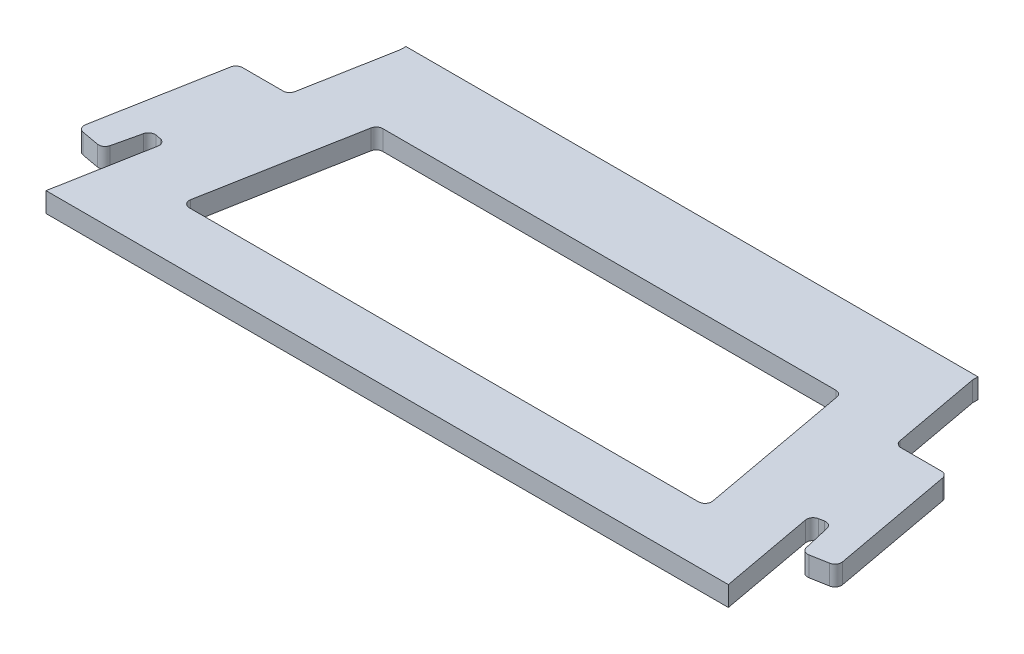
ISO-10303-21;
HEADER;
FILE_DESCRIPTION(('STEP AP214'),'2;1');
FILE_NAME('part.step','',(''),(''),'','','');
FILE_SCHEMA(('AUTOMOTIVE_DESIGN { 1 0 10303 214 1 1 1 1 }'));
ENDSEC;
DATA;
#1=APPLICATION_CONTEXT('core data for automotive mechanical design processes');
#2=APPLICATION_PROTOCOL_DEFINITION('international standard','automotive_design',2000,#1);
#3=PRODUCT_CONTEXT('',#1,'mechanical');
#4=PRODUCT('Part','Part','',(#3));
#5=PRODUCT_RELATED_PRODUCT_CATEGORY('part','',(#4));
#6=PRODUCT_DEFINITION_FORMATION('','',#4);
#7=PRODUCT_DEFINITION_CONTEXT('part definition',#1,'design');
#8=PRODUCT_DEFINITION('design','',#6,#7);
#9=PRODUCT_DEFINITION_SHAPE('','',#8);
#10=(LENGTH_UNIT() NAMED_UNIT(*) SI_UNIT(.MILLI.,.METRE.));
#11=(NAMED_UNIT(*) PLANE_ANGLE_UNIT() SI_UNIT($,.RADIAN.));
#12=(NAMED_UNIT(*) SI_UNIT($,.STERADIAN.) SOLID_ANGLE_UNIT());
#13=UNCERTAINTY_MEASURE_WITH_UNIT(LENGTH_MEASURE(1.E-05),#10,'distance_accuracy_value','');
#14=(GEOMETRIC_REPRESENTATION_CONTEXT(3) GLOBAL_UNCERTAINTY_ASSIGNED_CONTEXT((#13)) GLOBAL_UNIT_ASSIGNED_CONTEXT((#10,
#11,#12)) REPRESENTATION_CONTEXT('',''));
#15=CARTESIAN_POINT('',(0.,0.,0.));
#16=DIRECTION('',(0.,0.,1.));
#17=DIRECTION('',(1.,0.,0.));
#18=AXIS2_PLACEMENT_3D('',#15,#16,#17);
#19=CARTESIAN_POINT('',(6.58991666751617,12.,-57.8494094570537));
#20=DIRECTION('',(0.,-1.,0.));
#21=DIRECTION('',(0.,0.,-1.));
#22=AXIS2_PLACEMENT_3D('',#19,#20,#21);
#23=PLANE('',#22);
#24=DIRECTION('',(1.,0.,0.));
#25=VECTOR('',#24,1.);
#26=CARTESIAN_POINT('',(412.7,12.,0.));
#27=LINE('',#26,#25);
#28=CARTESIAN_POINT('',(0.,12.,0.));
#29=VERTEX_POINT('',#28);
#30=CARTESIAN_POINT('',(412.7,12.,0.));
#31=VERTEX_POINT('',#30);
#32=EDGE_CURVE('E343',#29,#31,#27,.T.);
#33=ORIENTED_EDGE('',*,*,#32,.T.);
#34=DIRECTION('',(-0.181174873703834,0.,-0.983450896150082));
#35=VECTOR('',#34,1.);
#36=CARTESIAN_POINT('',(402.176279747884,12.,-57.1247099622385));
#37=LINE('',#36,#35);
#38=CARTESIAN_POINT('',(402.176279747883,12.,-57.1247099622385));
#39=VERTEX_POINT('',#38);
#40=EDGE_CURVE('E346',#31,#39,#37,.T.);
#41=ORIENTED_EDGE('',*,*,#40,.T.);
#42=CARTESIAN_POINT('',(406.110083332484,12.,-57.8494094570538));
#43=DIRECTION('',(0.,-1.,0.));
#44=DIRECTION('',(0.,0.,1.));
#45=AXIS2_PLACEMENT_3D('',#42,#43,#44);
#46=CIRCLE('',#45,4.00000000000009);
#47=CARTESIAN_POINT('',(405.369598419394,12.,-61.7802722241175));
#48=VERTEX_POINT('',#47);
#49=EDGE_CURVE('E349',#39,#48,#46,.T.);
#50=ORIENTED_EDGE('',*,*,#49,.T.);
#51=DIRECTION('',(0.982715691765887,0.,-0.185121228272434));
#52=VECTOR('',#51,1.);
#53=CARTESIAN_POINT('',(408.44790778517,12.,-62.3601555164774));
#54=LINE('',#53,#52);
#55=CARTESIAN_POINT('',(408.44790778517,12.,-62.3601555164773));
#56=VERTEX_POINT('',#55);
#57=EDGE_CURVE('E351',#48,#56,#54,.T.);
#58=ORIENTED_EDGE('',*,*,#57,.T.);
#59=CARTESIAN_POINT('',(409.18839269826,12.,-58.4292927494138));
#60=DIRECTION('',(0.,-1.,0.));
#61=DIRECTION('',(0.,0.,1.));
#62=AXIS2_PLACEMENT_3D('',#59,#60,#61);
#63=CIRCLE('',#62,4.00000000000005);
#64=CARTESIAN_POINT('',(413.085272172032,12.,-59.3316953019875));
#65=VERTEX_POINT('',#64);
#66=EDGE_CURVE('E353',#56,#65,#63,.T.);
#67=ORIENTED_EDGE('',*,*,#66,.T.);
#68=DIRECTION('',(0.225600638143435,0.,0.974219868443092));
#69=VECTOR('',#68,1.);
#70=CARTESIAN_POINT('',(416.877618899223,12.,-42.9550593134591));
#71=LINE('',#70,#69);
#72=CARTESIAN_POINT('',(416.877618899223,12.,-42.9550593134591));
#73=VERTEX_POINT('',#72);
#74=EDGE_CURVE('E355',#65,#73,#71,.T.);
#75=ORIENTED_EDGE('',*,*,#74,.T.);
#76=CARTESIAN_POINT('',(420.774498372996,12.,-43.8574618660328));
#77=DIRECTION('',(0.,1.,0.));
#78=DIRECTION('',(0.,0.,-1.));
#79=AXIS2_PLACEMENT_3D('',#76,#77,#78);
#80=CIRCLE('',#79,3.99999999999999);
#81=CARTESIAN_POINT('',(421.487522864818,12.,-39.9215253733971));
#82=VERTEX_POINT('',#81);
#83=EDGE_CURVE('E357',#73,#82,#80,.T.);
#84=ORIENTED_EDGE('',*,*,#83,.T.);
#85=DIRECTION('',(0.983984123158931,0.,-0.178256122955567));
#86=VECTOR('',#85,1.);
#87=CARTESIAN_POINT('',(432.083346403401,12.,-41.8410384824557));
#88=LINE('',#87,#86);
#89=CARTESIAN_POINT('',(432.083346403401,12.,-41.8410384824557));
#90=VERTEX_POINT('',#89);
#91=EDGE_CURVE('E359',#82,#90,#88,.T.);
#92=ORIENTED_EDGE('',*,*,#91,.T.);
#93=CARTESIAN_POINT('',(431.370321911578,12.,-45.7769749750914));
#94=DIRECTION('',(0.,1.,0.));
#95=DIRECTION('',(0.,0.,-1.));
#96=AXIS2_PLACEMENT_3D('',#93,#94,#95);
#97=CIRCLE('',#96,4.);
#98=CARTESIAN_POINT('',(435.304125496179,12.,-46.5016744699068));
#99=VERTEX_POINT('',#98);
#100=EDGE_CURVE('E361',#90,#99,#97,.T.);
#101=ORIENTED_EDGE('',*,*,#100,.T.);
#102=DIRECTION('',(-0.181174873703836,0.,-0.983450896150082));
#103=VECTOR('',#102,1.);
#104=CARTESIAN_POINT('',(421.652598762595,12.,-120.604699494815));
#105=LINE('',#104,#103);
#106=CARTESIAN_POINT('',(421.652598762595,12.,-120.604699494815));
#107=VERTEX_POINT('',#106);
#108=EDGE_CURVE('E363',#99,#107,#105,.T.);
#109=ORIENTED_EDGE('',*,*,#108,.T.);
#110=CARTESIAN_POINT('',(417.718795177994,12.,-119.88));
#111=DIRECTION('',(0.,1.,0.));
#112=DIRECTION('',(0.,0.,-1.));
#113=AXIS2_PLACEMENT_3D('',#110,#111,#112);
#114=CIRCLE('',#113,4.);
#115=CARTESIAN_POINT('',(417.718795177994,12.,-123.88));
#116=VERTEX_POINT('',#115);
#117=EDGE_CURVE('E365',#107,#116,#114,.T.);
#118=ORIENTED_EDGE('',*,*,#117,.T.);
#119=DIRECTION('',(-1.,0.,0.));
#120=VECTOR('',#119,1.);
#121=CARTESIAN_POINT('',(393.208795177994,12.,-123.88));
#122=LINE('',#121,#120);
#123=CARTESIAN_POINT('',(393.208795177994,12.,-123.88));
#124=VERTEX_POINT('',#123);
#125=EDGE_CURVE('E367',#116,#124,#122,.T.);
#126=ORIENTED_EDGE('',*,*,#125,.T.);
#127=CARTESIAN_POINT('',(393.208795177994,12.,-127.88));
#128=DIRECTION('',(0.,-1.,0.));
#129=DIRECTION('',(0.,0.,-1.));
#130=AXIS2_PLACEMENT_3D('',#127,#128,#129);
#131=CIRCLE('',#130,4.00000000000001);
#132=CARTESIAN_POINT('',(389.274991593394,12.,-127.155300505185));
#133=VERTEX_POINT('',#132);
#134=EDGE_CURVE('E369',#124,#133,#131,.T.);
#135=ORIENTED_EDGE('',*,*,#134,.T.);
#136=DIRECTION('',(-0.181174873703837,0.,-0.983450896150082));
#137=VECTOR('',#136,1.);
#138=CARTESIAN_POINT('',(379.35,12.,-181.03));
#139=LINE('',#138,#137);
#140=CARTESIAN_POINT('',(379.35,12.,-181.03));
#141=VERTEX_POINT('',#140);
#142=EDGE_CURVE('E371',#133,#141,#139,.T.);
#143=ORIENTED_EDGE('',*,*,#142,.T.);
#144=DIRECTION('',(0.,0.,-1.));
#145=VECTOR('',#144,1.);
#146=CARTESIAN_POINT('',(379.35,12.,-181.03));
#147=LINE('',#146,#145);
#148=CARTESIAN_POINT('',(379.35,12.,-184.33));
#149=VERTEX_POINT('',#148);
#150=EDGE_CURVE('E373',#141,#149,#147,.T.);
#151=ORIENTED_EDGE('',*,*,#150,.T.);
#152=DIRECTION('',(-1.,0.,0.));
#153=VECTOR('',#152,1.);
#154=CARTESIAN_POINT('',(379.35,12.,-184.33));
#155=LINE('',#154,#153);
#156=CARTESIAN_POINT('',(33.35,12.,-184.33));
#157=VERTEX_POINT('',#156);
#158=EDGE_CURVE('E375',#149,#157,#155,.T.);
#159=ORIENTED_EDGE('',*,*,#158,.T.);
#160=DIRECTION('',(0.,0.,1.));
#161=VECTOR('',#160,1.);
#162=CARTESIAN_POINT('',(33.35,12.,-184.33));
#163=LINE('',#162,#161);
#164=CARTESIAN_POINT('',(33.35,12.,-181.03));
#165=VERTEX_POINT('',#164);
#166=EDGE_CURVE('E377',#157,#165,#163,.T.);
#167=ORIENTED_EDGE('',*,*,#166,.T.);
#168=DIRECTION('',(-0.181174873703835,0.,0.983450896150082));
#169=VECTOR('',#168,1.);
#170=CARTESIAN_POINT('',(23.4250084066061,12.,-127.155300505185));
#171=LINE('',#170,#169);
#172=CARTESIAN_POINT('',(23.4250084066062,12.,-127.155300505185));
#173=VERTEX_POINT('',#172);
#174=EDGE_CURVE('E379',#165,#173,#171,.T.);
#175=ORIENTED_EDGE('',*,*,#174,.T.);
#176=CARTESIAN_POINT('',(19.4912048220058,12.,-127.88));
#177=DIRECTION('',(0.,-1.,0.));
#178=DIRECTION('',(0.,0.,1.));
#179=AXIS2_PLACEMENT_3D('',#176,#177,#178);
#180=CIRCLE('',#179,4.00000000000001);
#181=CARTESIAN_POINT('',(19.4912048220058,12.,-123.88));
#182=VERTEX_POINT('',#181);
#183=EDGE_CURVE('E381',#173,#182,#180,.T.);
#184=ORIENTED_EDGE('',*,*,#183,.T.);
#185=DIRECTION('',(-1.,0.,0.));
#186=VECTOR('',#185,1.);
#187=CARTESIAN_POINT('',(19.4912048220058,12.,-123.88));
#188=LINE('',#187,#186);
#189=CARTESIAN_POINT('',(-5.01879517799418,12.,-123.88));
#190=VERTEX_POINT('',#189);
#191=EDGE_CURVE('E383',#182,#190,#188,.T.);
#192=ORIENTED_EDGE('',*,*,#191,.T.);
#193=CARTESIAN_POINT('',(-5.01879517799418,12.,-119.88));
#194=DIRECTION('',(0.,1.,0.));
#195=DIRECTION('',(0.,0.,1.));
#196=AXIS2_PLACEMENT_3D('',#193,#194,#195);
#197=CIRCLE('',#196,4.);
#198=CARTESIAN_POINT('',(-8.9525987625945,12.,-120.604699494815));
#199=VERTEX_POINT('',#198);
#200=EDGE_CURVE('E385',#190,#199,#197,.T.);
#201=ORIENTED_EDGE('',*,*,#200,.T.);
#202=DIRECTION('',(-0.181174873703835,0.,0.983450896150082));
#203=VECTOR('',#202,1.);
#204=CARTESIAN_POINT('',(-8.9525987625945,12.,-120.604699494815));
#205=LINE('',#204,#203);
#206=CARTESIAN_POINT('',(-22.6041254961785,12.,-46.5016744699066));
#207=VERTEX_POINT('',#206);
#208=EDGE_CURVE('E387',#199,#207,#205,.T.);
#209=ORIENTED_EDGE('',*,*,#208,.T.);
#210=CARTESIAN_POINT('',(-18.6703219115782,12.,-45.7769749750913));
#211=DIRECTION('',(0.,1.,0.));
#212=DIRECTION('',(0.,0.,1.));
#213=AXIS2_PLACEMENT_3D('',#210,#211,#212);
#214=CIRCLE('',#213,4.);
#215=CARTESIAN_POINT('',(-19.3833464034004,12.,-41.8410384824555));
#216=VERTEX_POINT('',#215);
#217=EDGE_CURVE('E389',#207,#216,#214,.T.);
#218=ORIENTED_EDGE('',*,*,#217,.T.);
#219=DIRECTION('',(0.983984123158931,0.,0.178256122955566));
#220=VECTOR('',#219,1.);
#221=CARTESIAN_POINT('',(-19.3833464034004,12.,-41.8410384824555));
#222=LINE('',#221,#220);
#223=CARTESIAN_POINT('',(-8.78752286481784,12.,-39.921525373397));
#224=VERTEX_POINT('',#223);
#225=EDGE_CURVE('E391',#216,#224,#222,.T.);
#226=ORIENTED_EDGE('',*,*,#225,.T.);
#227=CARTESIAN_POINT('',(-8.07449837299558,12.,-43.8574618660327));
#228=DIRECTION('',(0.,1.,0.));
#229=DIRECTION('',(0.,0.,1.));
#230=AXIS2_PLACEMENT_3D('',#227,#228,#229);
#231=CIRCLE('',#230,4.);
#232=CARTESIAN_POINT('',(-4.17761889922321,12.,-42.955059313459));
#233=VERTEX_POINT('',#232);
#234=EDGE_CURVE('E393',#224,#233,#231,.T.);
#235=ORIENTED_EDGE('',*,*,#234,.T.);
#236=DIRECTION('',(0.225600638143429,0.,-0.974219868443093));
#237=VECTOR('',#236,1.);
#238=CARTESIAN_POINT('',(-4.17761889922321,12.,-42.955059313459));
#239=LINE('',#238,#237);
#240=CARTESIAN_POINT('',(-0.385272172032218,12.,-59.3316953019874));
#241=VERTEX_POINT('',#240);
#242=EDGE_CURVE('E395',#233,#241,#239,.T.);
#243=ORIENTED_EDGE('',*,*,#242,.T.);
#244=CARTESIAN_POINT('',(3.51160730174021,12.,-58.4292927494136));
#245=DIRECTION('',(0.,-1.,0.));
#246=DIRECTION('',(0.,0.,-1.));
#247=AXIS2_PLACEMENT_3D('',#244,#245,#246);
#248=CIRCLE('',#247,4.00000000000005);
#249=CARTESIAN_POINT('',(4.25209221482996,12.,-62.3601555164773));
#250=VERTEX_POINT('',#249);
#251=EDGE_CURVE('E397',#241,#250,#248,.T.);
#252=ORIENTED_EDGE('',*,*,#251,.T.);
#253=DIRECTION('',(0.982715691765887,0.,0.185121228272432));
#254=VECTOR('',#253,1.);
#255=CARTESIAN_POINT('',(4.25209221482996,12.,-62.3601555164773));
#256=LINE('',#255,#254);
#257=CARTESIAN_POINT('',(7.33040158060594,12.,-61.7802722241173));
#258=VERTEX_POINT('',#257);
#259=EDGE_CURVE('E399',#250,#258,#256,.T.);
#260=ORIENTED_EDGE('',*,*,#259,.T.);
#261=CARTESIAN_POINT('',(6.58991666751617,12.,-57.8494094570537));
#262=DIRECTION('',(0.,-1.,0.));
#263=DIRECTION('',(0.,0.,-1.));
#264=AXIS2_PLACEMENT_3D('',#261,#262,#263);
#265=CIRCLE('',#264,4.00000000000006);
#266=CARTESIAN_POINT('',(10.5237202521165,12.,-57.1247099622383));
#267=VERTEX_POINT('',#266);
#268=EDGE_CURVE('E401',#258,#267,#265,.T.);
#269=ORIENTED_EDGE('',*,*,#268,.T.);
#270=DIRECTION('',(-0.181174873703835,0.,0.983450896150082));
#271=VECTOR('',#270,1.);
#272=CARTESIAN_POINT('',(0.,12.,0.));
#273=LINE('',#272,#271);
#274=EDGE_CURVE('E403',#267,#29,#273,.T.);
#275=ORIENTED_EDGE('',*,*,#274,.T.);
#276=EDGE_LOOP('',(#33,#41,#50,#58,#67,#75,#84,#92,#101,#109,#118,#126,#135,#143,#151,#159,#167,
#175,#184,#192,#201,#209,#218,#226,#235,#243,#252,#260,#269,#275));
#277=FACE_BOUND('',#276,.T.);
#278=CARTESIAN_POINT('',(52.4118012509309,12.,-38.33));
#279=DIRECTION('',(0.,1.,0.));
#280=DIRECTION('',(0.,0.,1.));
#281=AXIS2_PLACEMENT_3D('',#278,#279,#280);
#282=CIRCLE('',#281,4.);
#283=CARTESIAN_POINT('',(48.4779976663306,12.,-39.0546994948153));
#284=VERTEX_POINT('',#283);
#285=CARTESIAN_POINT('',(52.4118012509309,12.,-34.33));
#286=VERTEX_POINT('',#285);
#287=EDGE_CURVE('E278',#284,#286,#282,.T.);
#288=ORIENTED_EDGE('',*,*,#287,.F.);
#289=DIRECTION('',(-0.181174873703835,0.,0.983450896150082));
#290=VECTOR('',#289,1.);
#291=CARTESIAN_POINT('',(65.4265697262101,12.,-131.054699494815));
#292=LINE('',#291,#290);
#293=CARTESIAN_POINT('',(65.4265697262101,12.,-131.054699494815));
#294=VERTEX_POINT('',#293);
#295=EDGE_CURVE('E311',#294,#284,#292,.T.);
#296=ORIENTED_EDGE('',*,*,#295,.F.);
#297=CARTESIAN_POINT('',(69.3603733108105,12.,-130.33));
#298=DIRECTION('',(0.,1.,0.));
#299=DIRECTION('',(0.,0.,1.));
#300=AXIS2_PLACEMENT_3D('',#297,#298,#299);
#301=CIRCLE('',#300,4.00000000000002);
#302=CARTESIAN_POINT('',(69.3603733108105,12.,-134.33));
#303=VERTEX_POINT('',#302);
#304=EDGE_CURVE('E309',#303,#294,#301,.T.);
#305=ORIENTED_EDGE('',*,*,#304,.F.);
#306=DIRECTION('',(-1.,0.,0.));
#307=VECTOR('',#306,1.);
#308=CARTESIAN_POINT('',(343.33962668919,12.,-134.33));
#309=LINE('',#308,#307);
#310=CARTESIAN_POINT('',(343.33962668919,12.,-134.33));
#311=VERTEX_POINT('',#310);
#312=EDGE_CURVE('E307',#311,#303,#309,.T.);
#313=ORIENTED_EDGE('',*,*,#312,.F.);
#314=CARTESIAN_POINT('',(343.33962668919,12.,-130.33));
#315=DIRECTION('',(0.,1.,0.));
#316=DIRECTION('',(0.,0.,-1.));
#317=AXIS2_PLACEMENT_3D('',#314,#315,#316);
#318=CIRCLE('',#317,4.00000000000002);
#319=CARTESIAN_POINT('',(347.27343027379,12.,-131.054699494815));
#320=VERTEX_POINT('',#319);
#321=EDGE_CURVE('E305',#320,#311,#318,.T.);
#322=ORIENTED_EDGE('',*,*,#321,.F.);
#323=DIRECTION('',(-0.181174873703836,0.,-0.983450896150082));
#324=VECTOR('',#323,1.);
#325=CARTESIAN_POINT('',(347.27343027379,12.,-131.054699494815));
#326=LINE('',#325,#324);
#327=CARTESIAN_POINT('',(364.222002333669,12.,-39.0546994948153));
#328=VERTEX_POINT('',#327);
#329=EDGE_CURVE('E301',#328,#320,#326,.T.);
#330=ORIENTED_EDGE('',*,*,#329,.F.);
#331=CARTESIAN_POINT('',(360.288198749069,12.,-38.33));
#332=DIRECTION('',(0.,1.,0.));
#333=DIRECTION('',(0.,0.,-1.));
#334=AXIS2_PLACEMENT_3D('',#331,#332,#333);
#335=CIRCLE('',#334,4.00000000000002);
#336=CARTESIAN_POINT('',(360.288198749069,12.,-34.3299999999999));
#337=VERTEX_POINT('',#336);
#338=EDGE_CURVE('E299',#337,#328,#335,.T.);
#339=ORIENTED_EDGE('',*,*,#338,.F.);
#340=DIRECTION('',(1.,0.,0.));
#341=VECTOR('',#340,1.);
#342=CARTESIAN_POINT('',(52.4118012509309,12.,-34.33));
#343=LINE('',#342,#341);
#344=EDGE_CURVE('E286',#286,#337,#343,.T.);
#345=ORIENTED_EDGE('',*,*,#344,.F.);
#346=EDGE_LOOP('',(#288,#296,#305,#313,#322,#330,#339,#345));
#347=FACE_BOUND('',#346,.T.);
#348=ADVANCED_FACE('F33',(#277,#347),#23,.F.);
#349=CARTESIAN_POINT('',(6.58991666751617,0.,-57.8494094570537));
#350=DIRECTION('',(0.,-1.,0.));
#351=DIRECTION('',(0.,0.,-1.));
#352=AXIS2_PLACEMENT_3D('',#349,#350,#351);
#353=PLANE('',#352);
#354=DIRECTION('',(1.,0.,0.));
#355=VECTOR('',#354,1.);
#356=CARTESIAN_POINT('',(412.7,0.,0.));
#357=LINE('',#356,#355);
#358=CARTESIAN_POINT('',(0.,0.,0.));
#359=VERTEX_POINT('',#358);
#360=CARTESIAN_POINT('',(412.7,0.,0.));
#361=VERTEX_POINT('',#360);
#362=EDGE_CURVE('E294',#359,#361,#357,.T.);
#363=ORIENTED_EDGE('',*,*,#362,.F.);
#364=DIRECTION('',(-0.181174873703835,0.,0.983450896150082));
#365=VECTOR('',#364,1.);
#366=CARTESIAN_POINT('',(0.,0.,0.));
#367=LINE('',#366,#365);
#368=CARTESIAN_POINT('',(10.5237202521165,0.,-57.1247099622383));
#369=VERTEX_POINT('',#368);
#370=EDGE_CURVE('E347',#369,#359,#367,.T.);
#371=ORIENTED_EDGE('',*,*,#370,.F.);
#372=CARTESIAN_POINT('',(6.58991666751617,0.,-57.8494094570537));
#373=DIRECTION('',(0.,-1.,0.));
#374=DIRECTION('',(0.,0.,-1.));
#375=AXIS2_PLACEMENT_3D('',#372,#373,#374);
#376=CIRCLE('',#375,4.00000000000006);
#377=CARTESIAN_POINT('',(7.33040158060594,0.,-61.7802722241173));
#378=VERTEX_POINT('',#377);
#379=EDGE_CURVE('E462',#378,#369,#376,.T.);
#380=ORIENTED_EDGE('',*,*,#379,.F.);
#381=DIRECTION('',(0.982715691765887,0.,0.185121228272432));
#382=VECTOR('',#381,1.);
#383=CARTESIAN_POINT('',(4.25209221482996,0.,-62.3601555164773));
#384=LINE('',#383,#382);
#385=CARTESIAN_POINT('',(4.25209221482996,0.,-62.3601555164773));
#386=VERTEX_POINT('',#385);
#387=EDGE_CURVE('E460',#386,#378,#384,.T.);
#388=ORIENTED_EDGE('',*,*,#387,.F.);
#389=CARTESIAN_POINT('',(3.51160730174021,0.,-58.4292927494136));
#390=DIRECTION('',(0.,-1.,0.));
#391=DIRECTION('',(0.,0.,-1.));
#392=AXIS2_PLACEMENT_3D('',#389,#390,#391);
#393=CIRCLE('',#392,4.00000000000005);
#394=CARTESIAN_POINT('',(-0.385272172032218,0.,-59.3316953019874));
#395=VERTEX_POINT('',#394);
#396=EDGE_CURVE('E458',#395,#386,#393,.T.);
#397=ORIENTED_EDGE('',*,*,#396,.F.);
#398=DIRECTION('',(0.225600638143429,0.,-0.974219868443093));
#399=VECTOR('',#398,1.);
#400=CARTESIAN_POINT('',(-4.17761889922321,0.,-42.955059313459));
#401=LINE('',#400,#399);
#402=CARTESIAN_POINT('',(-4.17761889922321,0.,-42.955059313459));
#403=VERTEX_POINT('',#402);
#404=EDGE_CURVE('E456',#403,#395,#401,.T.);
#405=ORIENTED_EDGE('',*,*,#404,.F.);
#406=CARTESIAN_POINT('',(-8.07449837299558,0.,-43.8574618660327));
#407=DIRECTION('',(0.,1.,0.));
#408=DIRECTION('',(0.,0.,1.));
#409=AXIS2_PLACEMENT_3D('',#406,#407,#408);
#410=CIRCLE('',#409,4.);
#411=CARTESIAN_POINT('',(-8.78752286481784,0.,-39.921525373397));
#412=VERTEX_POINT('',#411);
#413=EDGE_CURVE('E454',#412,#403,#410,.T.);
#414=ORIENTED_EDGE('',*,*,#413,.F.);
#415=DIRECTION('',(0.983984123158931,0.,0.178256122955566));
#416=VECTOR('',#415,1.);
#417=CARTESIAN_POINT('',(-19.3833464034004,0.,-41.8410384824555));
#418=LINE('',#417,#416);
#419=CARTESIAN_POINT('',(-19.3833464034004,0.,-41.8410384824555));
#420=VERTEX_POINT('',#419);
#421=EDGE_CURVE('E452',#420,#412,#418,.T.);
#422=ORIENTED_EDGE('',*,*,#421,.F.);
#423=CARTESIAN_POINT('',(-18.6703219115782,0.,-45.7769749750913));
#424=DIRECTION('',(0.,1.,0.));
#425=DIRECTION('',(0.,0.,1.));
#426=AXIS2_PLACEMENT_3D('',#423,#424,#425);
#427=CIRCLE('',#426,4.);
#428=CARTESIAN_POINT('',(-22.6041254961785,0.,-46.5016744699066));
#429=VERTEX_POINT('',#428);
#430=EDGE_CURVE('E450',#429,#420,#427,.T.);
#431=ORIENTED_EDGE('',*,*,#430,.F.);
#432=DIRECTION('',(-0.181174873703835,0.,0.983450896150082));
#433=VECTOR('',#432,1.);
#434=CARTESIAN_POINT('',(-8.9525987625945,0.,-120.604699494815));
#435=LINE('',#434,#433);
#436=CARTESIAN_POINT('',(-8.9525987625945,0.,-120.604699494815));
#437=VERTEX_POINT('',#436);
#438=EDGE_CURVE('E448',#437,#429,#435,.T.);
#439=ORIENTED_EDGE('',*,*,#438,.F.);
#440=CARTESIAN_POINT('',(-5.01879517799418,0.,-119.88));
#441=DIRECTION('',(0.,1.,0.));
#442=DIRECTION('',(0.,0.,1.));
#443=AXIS2_PLACEMENT_3D('',#440,#441,#442);
#444=CIRCLE('',#443,4.);
#445=CARTESIAN_POINT('',(-5.01879517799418,0.,-123.88));
#446=VERTEX_POINT('',#445);
#447=EDGE_CURVE('E446',#446,#437,#444,.T.);
#448=ORIENTED_EDGE('',*,*,#447,.F.);
#449=DIRECTION('',(-1.,0.,0.));
#450=VECTOR('',#449,1.);
#451=CARTESIAN_POINT('',(19.4912048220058,0.,-123.88));
#452=LINE('',#451,#450);
#453=CARTESIAN_POINT('',(19.4912048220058,0.,-123.88));
#454=VERTEX_POINT('',#453);
#455=EDGE_CURVE('E444',#454,#446,#452,.T.);
#456=ORIENTED_EDGE('',*,*,#455,.F.);
#457=CARTESIAN_POINT('',(19.4912048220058,0.,-127.88));
#458=DIRECTION('',(0.,-1.,0.));
#459=DIRECTION('',(0.,0.,1.));
#460=AXIS2_PLACEMENT_3D('',#457,#458,#459);
#461=CIRCLE('',#460,4.00000000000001);
#462=CARTESIAN_POINT('',(23.4250084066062,0.,-127.155300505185));
#463=VERTEX_POINT('',#462);
#464=EDGE_CURVE('E442',#463,#454,#461,.T.);
#465=ORIENTED_EDGE('',*,*,#464,.F.);
#466=DIRECTION('',(-0.181174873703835,0.,0.983450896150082));
#467=VECTOR('',#466,1.);
#468=CARTESIAN_POINT('',(23.4250084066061,0.,-127.155300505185));
#469=LINE('',#468,#467);
#470=CARTESIAN_POINT('',(33.35,0.,-181.03));
#471=VERTEX_POINT('',#470);
#472=EDGE_CURVE('E440',#471,#463,#469,.T.);
#473=ORIENTED_EDGE('',*,*,#472,.F.);
#474=DIRECTION('',(0.,0.,1.));
#475=VECTOR('',#474,1.);
#476=CARTESIAN_POINT('',(33.35,0.,-184.33));
#477=LINE('',#476,#475);
#478=CARTESIAN_POINT('',(33.35,0.,-184.33));
#479=VERTEX_POINT('',#478);
#480=EDGE_CURVE('E438',#479,#471,#477,.T.);
#481=ORIENTED_EDGE('',*,*,#480,.F.);
#482=DIRECTION('',(-1.,0.,0.));
#483=VECTOR('',#482,1.);
#484=CARTESIAN_POINT('',(379.35,0.,-184.33));
#485=LINE('',#484,#483);
#486=CARTESIAN_POINT('',(379.35,0.,-184.33));
#487=VERTEX_POINT('',#486);
#488=EDGE_CURVE('E436',#487,#479,#485,.T.);
#489=ORIENTED_EDGE('',*,*,#488,.F.);
#490=DIRECTION('',(0.,0.,-1.));
#491=VECTOR('',#490,1.);
#492=CARTESIAN_POINT('',(379.35,0.,-181.03));
#493=LINE('',#492,#491);
#494=CARTESIAN_POINT('',(379.35,0.,-181.03));
#495=VERTEX_POINT('',#494);
#496=EDGE_CURVE('E434',#495,#487,#493,.T.);
#497=ORIENTED_EDGE('',*,*,#496,.F.);
#498=DIRECTION('',(-0.181174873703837,0.,-0.983450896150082));
#499=VECTOR('',#498,1.);
#500=CARTESIAN_POINT('',(379.35,0.,-181.03));
#501=LINE('',#500,#499);
#502=CARTESIAN_POINT('',(389.274991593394,0.,-127.155300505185));
#503=VERTEX_POINT('',#502);
#504=EDGE_CURVE('E432',#503,#495,#501,.T.);
#505=ORIENTED_EDGE('',*,*,#504,.F.);
#506=CARTESIAN_POINT('',(393.208795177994,0.,-127.88));
#507=DIRECTION('',(0.,-1.,0.));
#508=DIRECTION('',(0.,0.,-1.));
#509=AXIS2_PLACEMENT_3D('',#506,#507,#508);
#510=CIRCLE('',#509,4.00000000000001);
#511=CARTESIAN_POINT('',(393.208795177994,0.,-123.88));
#512=VERTEX_POINT('',#511);
#513=EDGE_CURVE('E430',#512,#503,#510,.T.);
#514=ORIENTED_EDGE('',*,*,#513,.F.);
#515=DIRECTION('',(-1.,0.,0.));
#516=VECTOR('',#515,1.);
#517=CARTESIAN_POINT('',(393.208795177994,0.,-123.88));
#518=LINE('',#517,#516);
#519=CARTESIAN_POINT('',(417.718795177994,0.,-123.88));
#520=VERTEX_POINT('',#519);
#521=EDGE_CURVE('E428',#520,#512,#518,.T.);
#522=ORIENTED_EDGE('',*,*,#521,.F.);
#523=CARTESIAN_POINT('',(417.718795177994,0.,-119.88));
#524=DIRECTION('',(0.,1.,0.));
#525=DIRECTION('',(0.,0.,-1.));
#526=AXIS2_PLACEMENT_3D('',#523,#524,#525);
#527=CIRCLE('',#526,4.);
#528=CARTESIAN_POINT('',(421.652598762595,0.,-120.604699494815));
#529=VERTEX_POINT('',#528);
#530=EDGE_CURVE('E426',#529,#520,#527,.T.);
#531=ORIENTED_EDGE('',*,*,#530,.F.);
#532=DIRECTION('',(-0.181174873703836,0.,-0.983450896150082));
#533=VECTOR('',#532,1.);
#534=CARTESIAN_POINT('',(421.652598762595,0.,-120.604699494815));
#535=LINE('',#534,#533);
#536=CARTESIAN_POINT('',(435.304125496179,0.,-46.5016744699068));
#537=VERTEX_POINT('',#536);
#538=EDGE_CURVE('E424',#537,#529,#535,.T.);
#539=ORIENTED_EDGE('',*,*,#538,.F.);
#540=CARTESIAN_POINT('',(431.370321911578,0.,-45.7769749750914));
#541=DIRECTION('',(0.,1.,0.));
#542=DIRECTION('',(0.,0.,-1.));
#543=AXIS2_PLACEMENT_3D('',#540,#541,#542);
#544=CIRCLE('',#543,4.);
#545=CARTESIAN_POINT('',(432.083346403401,0.,-41.8410384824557));
#546=VERTEX_POINT('',#545);
#547=EDGE_CURVE('E422',#546,#537,#544,.T.);
#548=ORIENTED_EDGE('',*,*,#547,.F.);
#549=DIRECTION('',(0.983984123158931,0.,-0.178256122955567));
#550=VECTOR('',#549,1.);
#551=CARTESIAN_POINT('',(432.083346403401,0.,-41.8410384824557));
#552=LINE('',#551,#550);
#553=CARTESIAN_POINT('',(421.487522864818,0.,-39.9215253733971));
#554=VERTEX_POINT('',#553);
#555=EDGE_CURVE('E420',#554,#546,#552,.T.);
#556=ORIENTED_EDGE('',*,*,#555,.F.);
#557=CARTESIAN_POINT('',(420.774498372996,0.,-43.8574618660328));
#558=DIRECTION('',(0.,1.,0.));
#559=DIRECTION('',(0.,0.,-1.));
#560=AXIS2_PLACEMENT_3D('',#557,#558,#559);
#561=CIRCLE('',#560,3.99999999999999);
#562=CARTESIAN_POINT('',(416.877618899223,0.,-42.9550593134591));
#563=VERTEX_POINT('',#562);
#564=EDGE_CURVE('E418',#563,#554,#561,.T.);
#565=ORIENTED_EDGE('',*,*,#564,.F.);
#566=DIRECTION('',(0.225600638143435,0.,0.974219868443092));
#567=VECTOR('',#566,1.);
#568=CARTESIAN_POINT('',(416.877618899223,0.,-42.9550593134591));
#569=LINE('',#568,#567);
#570=CARTESIAN_POINT('',(413.085272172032,0.,-59.3316953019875));
#571=VERTEX_POINT('',#570);
#572=EDGE_CURVE('E416',#571,#563,#569,.T.);
#573=ORIENTED_EDGE('',*,*,#572,.F.);
#574=CARTESIAN_POINT('',(409.18839269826,0.,-58.4292927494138));
#575=DIRECTION('',(0.,-1.,0.));
#576=DIRECTION('',(0.,0.,1.));
#577=AXIS2_PLACEMENT_3D('',#574,#575,#576);
#578=CIRCLE('',#577,4.00000000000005);
#579=CARTESIAN_POINT('',(408.44790778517,0.,-62.3601555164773));
#580=VERTEX_POINT('',#579);
#581=EDGE_CURVE('E414',#580,#571,#578,.T.);
#582=ORIENTED_EDGE('',*,*,#581,.F.);
#583=DIRECTION('',(0.982715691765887,0.,-0.185121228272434));
#584=VECTOR('',#583,1.);
#585=CARTESIAN_POINT('',(408.44790778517,0.,-62.3601555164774));
#586=LINE('',#585,#584);
#587=CARTESIAN_POINT('',(405.369598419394,0.,-61.7802722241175));
#588=VERTEX_POINT('',#587);
#589=EDGE_CURVE('E412',#588,#580,#586,.T.);
#590=ORIENTED_EDGE('',*,*,#589,.F.);
#591=CARTESIAN_POINT('',(406.110083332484,0.,-57.8494094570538));
#592=DIRECTION('',(0.,-1.,0.));
#593=DIRECTION('',(0.,0.,1.));
#594=AXIS2_PLACEMENT_3D('',#591,#592,#593);
#595=CIRCLE('',#594,4.00000000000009);
#596=CARTESIAN_POINT('',(402.176279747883,0.,-57.1247099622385));
#597=VERTEX_POINT('',#596);
#598=EDGE_CURVE('E410',#597,#588,#595,.T.);
#599=ORIENTED_EDGE('',*,*,#598,.F.);
#600=DIRECTION('',(-0.181174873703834,0.,-0.983450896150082));
#601=VECTOR('',#600,1.);
#602=CARTESIAN_POINT('',(402.176279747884,0.,-57.1247099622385));
#603=LINE('',#602,#601);
#604=EDGE_CURVE('E408',#361,#597,#603,.T.);
#605=ORIENTED_EDGE('',*,*,#604,.F.);
#606=EDGE_LOOP('',(#363,#371,#380,#388,#397,#405,#414,#422,#431,#439,#448,#456,#465,#473,#481,
#489,#497,#505,#514,#522,#531,#539,#548,#556,#565,#573,#582,#590,#599,#605));
#607=FACE_BOUND('',#606,.T.);
#608=DIRECTION('',(-0.181174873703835,0.,0.983450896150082));
#609=VECTOR('',#608,1.);
#610=CARTESIAN_POINT('',(65.4265697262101,0.,-131.054699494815));
#611=LINE('',#610,#609);
#612=CARTESIAN_POINT('',(65.4265697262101,0.,-131.054699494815));
#613=VERTEX_POINT('',#612);
#614=CARTESIAN_POINT('',(48.4779976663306,0.,-39.0546994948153));
#615=VERTEX_POINT('',#614);
#616=EDGE_CURVE('E287',#613,#615,#611,.T.);
#617=ORIENTED_EDGE('',*,*,#616,.T.);
#618=CARTESIAN_POINT('',(52.4118012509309,0.,-38.33));
#619=DIRECTION('',(0.,1.,0.));
#620=DIRECTION('',(0.,0.,1.));
#621=AXIS2_PLACEMENT_3D('',#618,#619,#620);
#622=CIRCLE('',#621,4.);
#623=CARTESIAN_POINT('',(52.4118012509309,0.,-34.33));
#624=VERTEX_POINT('',#623);
#625=EDGE_CURVE('E56',#615,#624,#622,.T.);
#626=ORIENTED_EDGE('',*,*,#625,.T.);
#627=DIRECTION('',(1.,0.,0.));
#628=VECTOR('',#627,1.);
#629=CARTESIAN_POINT('',(52.4118012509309,0.,-34.33));
#630=LINE('',#629,#628);
#631=CARTESIAN_POINT('',(360.288198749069,0.,-34.3299999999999));
#632=VERTEX_POINT('',#631);
#633=EDGE_CURVE('E293',#624,#632,#630,.T.);
#634=ORIENTED_EDGE('',*,*,#633,.T.);
#635=CARTESIAN_POINT('',(360.288198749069,0.,-38.33));
#636=DIRECTION('',(0.,1.,0.));
#637=DIRECTION('',(0.,0.,-1.));
#638=AXIS2_PLACEMENT_3D('',#635,#636,#637);
#639=CIRCLE('',#638,4.00000000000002);
#640=CARTESIAN_POINT('',(364.222002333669,0.,-39.0546994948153));
#641=VERTEX_POINT('',#640);
#642=EDGE_CURVE('E315',#632,#641,#639,.T.);
#643=ORIENTED_EDGE('',*,*,#642,.T.);
#644=DIRECTION('',(-0.181174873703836,0.,-0.983450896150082));
#645=VECTOR('',#644,1.);
#646=CARTESIAN_POINT('',(347.27343027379,0.,-131.054699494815));
#647=LINE('',#646,#645);
#648=CARTESIAN_POINT('',(347.27343027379,0.,-131.054699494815));
#649=VERTEX_POINT('',#648);
#650=EDGE_CURVE('E318',#641,#649,#647,.T.);
#651=ORIENTED_EDGE('',*,*,#650,.T.);
#652=CARTESIAN_POINT('',(343.33962668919,0.,-130.33));
#653=DIRECTION('',(0.,1.,0.));
#654=DIRECTION('',(0.,0.,-1.));
#655=AXIS2_PLACEMENT_3D('',#652,#653,#654);
#656=CIRCLE('',#655,4.00000000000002);
#657=CARTESIAN_POINT('',(343.33962668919,0.,-134.33));
#658=VERTEX_POINT('',#657);
#659=EDGE_CURVE('E321',#649,#658,#656,.T.);
#660=ORIENTED_EDGE('',*,*,#659,.T.);
#661=DIRECTION('',(-1.,0.,0.));
#662=VECTOR('',#661,1.);
#663=CARTESIAN_POINT('',(343.33962668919,0.,-134.33));
#664=LINE('',#663,#662);
#665=CARTESIAN_POINT('',(69.3603733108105,0.,-134.33));
#666=VERTEX_POINT('',#665);
#667=EDGE_CURVE('E324',#658,#666,#664,.T.);
#668=ORIENTED_EDGE('',*,*,#667,.T.);
#669=CARTESIAN_POINT('',(69.3603733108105,0.,-130.33));
#670=DIRECTION('',(0.,1.,0.));
#671=DIRECTION('',(0.,0.,1.));
#672=AXIS2_PLACEMENT_3D('',#669,#670,#671);
#673=CIRCLE('',#672,4.00000000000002);
#674=EDGE_CURVE('E327',#666,#613,#673,.T.);
#675=ORIENTED_EDGE('',*,*,#674,.T.);
#676=EDGE_LOOP('',(#617,#626,#634,#643,#651,#660,#668,#675));
#677=FACE_BOUND('',#676,.T.);
#678=ADVANCED_FACE('F558',(#607,#677),#353,.T.);
#679=CARTESIAN_POINT('',(412.7,12.,0.));
#680=DIRECTION('',(0.,0.,-1.));
#681=DIRECTION('',(-1.,0.,0.));
#682=AXIS2_PLACEMENT_3D('',#679,#680,#681);
#683=PLANE('',#682);
#684=ORIENTED_EDGE('',*,*,#362,.T.);
#685=DIRECTION('',(0.,-1.,0.));
#686=VECTOR('',#685,1.);
#687=CARTESIAN_POINT('',(412.7,12.,0.));
#688=LINE('',#687,#686);
#689=EDGE_CURVE('E11',#31,#361,#688,.T.);
#690=ORIENTED_EDGE('',*,*,#689,.F.);
#691=ORIENTED_EDGE('',*,*,#32,.F.);
#692=DIRECTION('',(0.,-1.,0.));
#693=VECTOR('',#692,1.);
#694=CARTESIAN_POINT('',(0.,12.,0.));
#695=LINE('',#694,#693);
#696=EDGE_CURVE('E405',#29,#359,#695,.T.);
#697=ORIENTED_EDGE('',*,*,#696,.T.);
#698=EDGE_LOOP('',(#684,#690,#691,#697));
#699=FACE_BOUND('',#698,.T.);
#700=ADVANCED_FACE('F35',(#699),#683,.F.);
#701=CARTESIAN_POINT('',(402.176279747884,12.,-57.1247099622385));
#702=DIRECTION('',(-0.983450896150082,0.,0.181174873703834));
#703=DIRECTION('',(0.181174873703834,0.,0.983450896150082));
#704=AXIS2_PLACEMENT_3D('',#701,#702,#703);
#705=PLANE('',#704);
#706=ORIENTED_EDGE('',*,*,#604,.T.);
#707=DIRECTION('',(0.,-1.,0.));
#708=VECTOR('',#707,1.);
#709=CARTESIAN_POINT('',(402.176279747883,12.,-57.1247099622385));
#710=LINE('',#709,#708);
#711=EDGE_CURVE('E41',#39,#597,#710,.T.);
#712=ORIENTED_EDGE('',*,*,#711,.F.);
#713=ORIENTED_EDGE('',*,*,#40,.F.);
#714=ORIENTED_EDGE('',*,*,#689,.T.);
#715=EDGE_LOOP('',(#706,#712,#713,#714));
#716=FACE_BOUND('',#715,.T.);
#717=ADVANCED_FACE('F575',(#716),#705,.F.);
#718=CARTESIAN_POINT('',(406.110083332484,12.,-57.8494094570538));
#719=DIRECTION('',(0.,-1.,0.));
#720=DIRECTION('',(0.,0.,-1.));
#721=AXIS2_PLACEMENT_3D('',#718,#719,#720);
#722=CYLINDRICAL_SURFACE('',#721,4.00000000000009);
#723=ORIENTED_EDGE('',*,*,#598,.T.);
#724=DIRECTION('',(0.,-1.,0.));
#725=VECTOR('',#724,1.);
#726=CARTESIAN_POINT('',(405.369598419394,12.,-61.7802722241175));
#727=LINE('',#726,#725);
#728=EDGE_CURVE('E545',#48,#588,#727,.T.);
#729=ORIENTED_EDGE('',*,*,#728,.F.);
#730=ORIENTED_EDGE('',*,*,#49,.F.);
#731=ORIENTED_EDGE('',*,*,#711,.T.);
#732=EDGE_LOOP('',(#723,#729,#730,#731));
#733=FACE_BOUND('',#732,.T.);
#734=ADVANCED_FACE('F552',(#733),#722,.F.);
#735=CARTESIAN_POINT('',(408.44790778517,12.,-62.3601555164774));
#736=DIRECTION('',(-0.185121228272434,0.,-0.982715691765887));
#737=DIRECTION('',(-0.982715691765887,0.,0.185121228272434));
#738=AXIS2_PLACEMENT_3D('',#735,#736,#737);
#739=PLANE('',#738);
#740=ORIENTED_EDGE('',*,*,#589,.T.);
#741=DIRECTION('',(0.,-1.,0.));
#742=VECTOR('',#741,1.);
#743=CARTESIAN_POINT('',(408.44790778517,12.,-62.3601555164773));
#744=LINE('',#743,#742);
#745=EDGE_CURVE('E542',#56,#580,#744,.T.);
#746=ORIENTED_EDGE('',*,*,#745,.F.);
#747=ORIENTED_EDGE('',*,*,#57,.F.);
#748=ORIENTED_EDGE('',*,*,#728,.T.);
#749=EDGE_LOOP('',(#740,#746,#747,#748));
#750=FACE_BOUND('',#749,.T.);
#751=ADVANCED_FACE('F564',(#750),#739,.F.);
#752=CARTESIAN_POINT('',(409.18839269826,12.,-58.4292927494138));
#753=DIRECTION('',(0.,-1.,0.));
#754=DIRECTION('',(0.,0.,-1.));
#755=AXIS2_PLACEMENT_3D('',#752,#753,#754);
#756=CYLINDRICAL_SURFACE('',#755,4.00000000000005);
#757=ORIENTED_EDGE('',*,*,#581,.T.);
#758=DIRECTION('',(0.,-1.,0.));
#759=VECTOR('',#758,1.);
#760=CARTESIAN_POINT('',(413.085272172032,12.,-59.3316953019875));
#761=LINE('',#760,#759);
#762=EDGE_CURVE('E539',#65,#571,#761,.T.);
#763=ORIENTED_EDGE('',*,*,#762,.F.);
#764=ORIENTED_EDGE('',*,*,#66,.F.);
#765=ORIENTED_EDGE('',*,*,#745,.T.);
#766=EDGE_LOOP('',(#757,#763,#764,#765));
#767=FACE_BOUND('',#766,.T.);
#768=ADVANCED_FACE('F568',(#767),#756,.F.);
#769=CARTESIAN_POINT('',(416.877618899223,12.,-42.9550593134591));
#770=DIRECTION('',(0.974219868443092,0.,-0.225600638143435));
#771=DIRECTION('',(-0.225600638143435,0.,-0.974219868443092));
#772=AXIS2_PLACEMENT_3D('',#769,#770,#771);
#773=PLANE('',#772);
#774=ORIENTED_EDGE('',*,*,#572,.T.);
#775=DIRECTION('',(0.,-1.,0.));
#776=VECTOR('',#775,1.);
#777=CARTESIAN_POINT('',(416.877618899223,12.,-42.9550593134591));
#778=LINE('',#777,#776);
#779=EDGE_CURVE('E536',#73,#563,#778,.T.);
#780=ORIENTED_EDGE('',*,*,#779,.F.);
#781=ORIENTED_EDGE('',*,*,#74,.F.);
#782=ORIENTED_EDGE('',*,*,#762,.T.);
#783=EDGE_LOOP('',(#774,#780,#781,#782));
#784=FACE_BOUND('',#783,.T.);
#785=ADVANCED_FACE('F698',(#784),#773,.F.);
#786=CARTESIAN_POINT('',(420.774498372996,12.,-43.8574618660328));
#787=DIRECTION('',(0.,-1.,0.));
#788=DIRECTION('',(0.,0.,-1.));
#789=AXIS2_PLACEMENT_3D('',#786,#787,#788);
#790=CYLINDRICAL_SURFACE('',#789,3.99999999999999);
#791=ORIENTED_EDGE('',*,*,#564,.T.);
#792=DIRECTION('',(0.,-1.,0.));
#793=VECTOR('',#792,1.);
#794=CARTESIAN_POINT('',(421.487522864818,12.,-39.9215253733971));
#795=LINE('',#794,#793);
#796=EDGE_CURVE('E533',#82,#554,#795,.T.);
#797=ORIENTED_EDGE('',*,*,#796,.F.);
#798=ORIENTED_EDGE('',*,*,#83,.F.);
#799=ORIENTED_EDGE('',*,*,#779,.T.);
#800=EDGE_LOOP('',(#791,#797,#798,#799));
#801=FACE_BOUND('',#800,.T.);
#802=ADVANCED_FACE('F696',(#801),#790,.T.);
#803=CARTESIAN_POINT('',(432.083346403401,12.,-41.8410384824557));
#804=DIRECTION('',(-0.178256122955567,0.,-0.983984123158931));
#805=DIRECTION('',(-0.983984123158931,0.,0.178256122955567));
#806=AXIS2_PLACEMENT_3D('',#803,#804,#805);
#807=PLANE('',#806);
#808=ORIENTED_EDGE('',*,*,#555,.T.);
#809=DIRECTION('',(0.,-1.,0.));
#810=VECTOR('',#809,1.);
#811=CARTESIAN_POINT('',(432.083346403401,12.,-41.8410384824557));
#812=LINE('',#811,#810);
#813=EDGE_CURVE('E530',#90,#546,#812,.T.);
#814=ORIENTED_EDGE('',*,*,#813,.F.);
#815=ORIENTED_EDGE('',*,*,#91,.F.);
#816=ORIENTED_EDGE('',*,*,#796,.T.);
#817=EDGE_LOOP('',(#808,#814,#815,#816));
#818=FACE_BOUND('',#817,.T.);
#819=ADVANCED_FACE('F692',(#818),#807,.F.);
#820=CARTESIAN_POINT('',(431.370321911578,12.,-45.7769749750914));
#821=DIRECTION('',(0.,-1.,0.));
#822=DIRECTION('',(0.,0.,-1.));
#823=AXIS2_PLACEMENT_3D('',#820,#821,#822);
#824=CYLINDRICAL_SURFACE('',#823,4.);
#825=ORIENTED_EDGE('',*,*,#547,.T.);
#826=DIRECTION('',(0.,-1.,0.));
#827=VECTOR('',#826,1.);
#828=CARTESIAN_POINT('',(435.304125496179,12.,-46.5016744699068));
#829=LINE('',#828,#827);
#830=EDGE_CURVE('E527',#99,#537,#829,.T.);
#831=ORIENTED_EDGE('',*,*,#830,.F.);
#832=ORIENTED_EDGE('',*,*,#100,.F.);
#833=ORIENTED_EDGE('',*,*,#813,.T.);
#834=EDGE_LOOP('',(#825,#831,#832,#833));
#835=FACE_BOUND('',#834,.T.);
#836=ADVANCED_FACE('F687',(#835),#824,.T.);
#837=CARTESIAN_POINT('',(421.652598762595,12.,-120.604699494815));
#838=DIRECTION('',(-0.983450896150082,0.,0.181174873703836));
#839=DIRECTION('',(0.181174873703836,0.,0.983450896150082));
#840=AXIS2_PLACEMENT_3D('',#837,#838,#839);
#841=PLANE('',#840);
#842=ORIENTED_EDGE('',*,*,#538,.T.);
#843=DIRECTION('',(0.,-1.,0.));
#844=VECTOR('',#843,1.);
#845=CARTESIAN_POINT('',(421.652598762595,12.,-120.604699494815));
#846=LINE('',#845,#844);
#847=EDGE_CURVE('E524',#107,#529,#846,.T.);
#848=ORIENTED_EDGE('',*,*,#847,.F.);
#849=ORIENTED_EDGE('',*,*,#108,.F.);
#850=ORIENTED_EDGE('',*,*,#830,.T.);
#851=EDGE_LOOP('',(#842,#848,#849,#850));
#852=FACE_BOUND('',#851,.T.);
#853=ADVANCED_FACE('F681',(#852),#841,.F.);
#854=CARTESIAN_POINT('',(417.718795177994,12.,-119.88));
#855=DIRECTION('',(0.,-1.,0.));
#856=DIRECTION('',(0.,0.,-1.));
#857=AXIS2_PLACEMENT_3D('',#854,#855,#856);
#858=CYLINDRICAL_SURFACE('',#857,4.);
#859=ORIENTED_EDGE('',*,*,#530,.T.);
#860=DIRECTION('',(0.,-1.,0.));
#861=VECTOR('',#860,1.);
#862=CARTESIAN_POINT('',(417.718795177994,12.,-123.88));
#863=LINE('',#862,#861);
#864=EDGE_CURVE('E521',#116,#520,#863,.T.);
#865=ORIENTED_EDGE('',*,*,#864,.F.);
#866=ORIENTED_EDGE('',*,*,#117,.F.);
#867=ORIENTED_EDGE('',*,*,#847,.T.);
#868=EDGE_LOOP('',(#859,#865,#866,#867));
#869=FACE_BOUND('',#868,.T.);
#870=ADVANCED_FACE('F677',(#869),#858,.T.);
#871=CARTESIAN_POINT('',(393.208795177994,12.,-123.88));
#872=DIRECTION('',(0.,0.,1.));
#873=DIRECTION('',(1.,0.,0.));
#874=AXIS2_PLACEMENT_3D('',#871,#872,#873);
#875=PLANE('',#874);
#876=ORIENTED_EDGE('',*,*,#521,.T.);
#877=DIRECTION('',(0.,-1.,0.));
#878=VECTOR('',#877,1.);
#879=CARTESIAN_POINT('',(393.208795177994,12.,-123.88));
#880=LINE('',#879,#878);
#881=EDGE_CURVE('E518',#124,#512,#880,.T.);
#882=ORIENTED_EDGE('',*,*,#881,.F.);
#883=ORIENTED_EDGE('',*,*,#125,.F.);
#884=ORIENTED_EDGE('',*,*,#864,.T.);
#885=EDGE_LOOP('',(#876,#882,#883,#884));
#886=FACE_BOUND('',#885,.T.);
#887=ADVANCED_FACE('F672',(#886),#875,.F.);
#888=CARTESIAN_POINT('',(393.208795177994,12.,-127.88));
#889=DIRECTION('',(0.,-1.,0.));
#890=DIRECTION('',(0.,0.,-1.));
#891=AXIS2_PLACEMENT_3D('',#888,#889,#890);
#892=CYLINDRICAL_SURFACE('',#891,4.00000000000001);
#893=ORIENTED_EDGE('',*,*,#513,.T.);
#894=DIRECTION('',(0.,-1.,0.));
#895=VECTOR('',#894,1.);
#896=CARTESIAN_POINT('',(389.274991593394,12.,-127.155300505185));
#897=LINE('',#896,#895);
#898=EDGE_CURVE('E515',#133,#503,#897,.T.);
#899=ORIENTED_EDGE('',*,*,#898,.F.);
#900=ORIENTED_EDGE('',*,*,#134,.F.);
#901=ORIENTED_EDGE('',*,*,#881,.T.);
#902=EDGE_LOOP('',(#893,#899,#900,#901));
#903=FACE_BOUND('',#902,.T.);
#904=ADVANCED_FACE('F666',(#903),#892,.F.);
#905=CARTESIAN_POINT('',(379.35,12.,-181.03));
#906=DIRECTION('',(-0.983450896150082,0.,0.181174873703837));
#907=DIRECTION('',(0.181174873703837,0.,0.983450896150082));
#908=AXIS2_PLACEMENT_3D('',#905,#906,#907);
#909=PLANE('',#908);
#910=ORIENTED_EDGE('',*,*,#504,.T.);
#911=DIRECTION('',(0.,-1.,0.));
#912=VECTOR('',#911,1.);
#913=CARTESIAN_POINT('',(379.35,12.,-181.03));
#914=LINE('',#913,#912);
#915=EDGE_CURVE('E512',#141,#495,#914,.T.);
#916=ORIENTED_EDGE('',*,*,#915,.F.);
#917=ORIENTED_EDGE('',*,*,#142,.F.);
#918=ORIENTED_EDGE('',*,*,#898,.T.);
#919=EDGE_LOOP('',(#910,#916,#917,#918));
#920=FACE_BOUND('',#919,.T.);
#921=ADVANCED_FACE('F662',(#920),#909,.F.);
#922=CARTESIAN_POINT('',(379.35,12.,-181.03));
#923=DIRECTION('',(-1.,0.,0.));
#924=DIRECTION('',(0.,0.,1.));
#925=AXIS2_PLACEMENT_3D('',#922,#923,#924);
#926=PLANE('',#925);
#927=ORIENTED_EDGE('',*,*,#496,.T.);
#928=DIRECTION('',(0.,-1.,0.));
#929=VECTOR('',#928,1.);
#930=CARTESIAN_POINT('',(379.35,12.,-184.33));
#931=LINE('',#930,#929);
#932=EDGE_CURVE('E509',#149,#487,#931,.T.);
#933=ORIENTED_EDGE('',*,*,#932,.F.);
#934=ORIENTED_EDGE('',*,*,#150,.F.);
#935=ORIENTED_EDGE('',*,*,#915,.T.);
#936=EDGE_LOOP('',(#927,#933,#934,#935));
#937=FACE_BOUND('',#936,.T.);
#938=ADVANCED_FACE('F657',(#937),#926,.F.);
#939=CARTESIAN_POINT('',(379.35,12.,-184.33));
#940=DIRECTION('',(0.,0.,1.));
#941=DIRECTION('',(1.,0.,0.));
#942=AXIS2_PLACEMENT_3D('',#939,#940,#941);
#943=PLANE('',#942);
#944=ORIENTED_EDGE('',*,*,#488,.T.);
#945=DIRECTION('',(0.,-1.,0.));
#946=VECTOR('',#945,1.);
#947=CARTESIAN_POINT('',(33.35,12.,-184.33));
#948=LINE('',#947,#946);
#949=EDGE_CURVE('E506',#157,#479,#948,.T.);
#950=ORIENTED_EDGE('',*,*,#949,.F.);
#951=ORIENTED_EDGE('',*,*,#158,.F.);
#952=ORIENTED_EDGE('',*,*,#932,.T.);
#953=EDGE_LOOP('',(#944,#950,#951,#952));
#954=FACE_BOUND('',#953,.T.);
#955=ADVANCED_FACE('F651',(#954),#943,.F.);
#956=CARTESIAN_POINT('',(33.35,12.,-184.33));
#957=DIRECTION('',(1.,0.,0.));
#958=DIRECTION('',(0.,0.,-1.));
#959=AXIS2_PLACEMENT_3D('',#956,#957,#958);
#960=PLANE('',#959);
#961=ORIENTED_EDGE('',*,*,#480,.T.);
#962=DIRECTION('',(0.,-1.,0.));
#963=VECTOR('',#962,1.);
#964=CARTESIAN_POINT('',(33.35,12.,-181.03));
#965=LINE('',#964,#963);
#966=EDGE_CURVE('E503',#165,#471,#965,.T.);
#967=ORIENTED_EDGE('',*,*,#966,.F.);
#968=ORIENTED_EDGE('',*,*,#166,.F.);
#969=ORIENTED_EDGE('',*,*,#949,.T.);
#970=EDGE_LOOP('',(#961,#967,#968,#969));
#971=FACE_BOUND('',#970,.T.);
#972=ADVANCED_FACE('F647',(#971),#960,.F.);
#973=CARTESIAN_POINT('',(23.4250084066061,12.,-127.155300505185));
#974=DIRECTION('',(0.983450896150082,0.,0.181174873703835));
#975=DIRECTION('',(0.181174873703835,0.,-0.983450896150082));
#976=AXIS2_PLACEMENT_3D('',#973,#974,#975);
#977=PLANE('',#976);
#978=ORIENTED_EDGE('',*,*,#472,.T.);
#979=DIRECTION('',(0.,-1.,0.));
#980=VECTOR('',#979,1.);
#981=CARTESIAN_POINT('',(23.4250084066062,12.,-127.155300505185));
#982=LINE('',#981,#980);
#983=EDGE_CURVE('E500',#173,#463,#982,.T.);
#984=ORIENTED_EDGE('',*,*,#983,.F.);
#985=ORIENTED_EDGE('',*,*,#174,.F.);
#986=ORIENTED_EDGE('',*,*,#966,.T.);
#987=EDGE_LOOP('',(#978,#984,#985,#986));
#988=FACE_BOUND('',#987,.T.);
#989=ADVANCED_FACE('F642',(#988),#977,.F.);
#990=CARTESIAN_POINT('',(19.4912048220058,12.,-127.88));
#991=DIRECTION('',(0.,-1.,0.));
#992=DIRECTION('',(0.,0.,-1.));
#993=AXIS2_PLACEMENT_3D('',#990,#991,#992);
#994=CYLINDRICAL_SURFACE('',#993,4.00000000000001);
#995=ORIENTED_EDGE('',*,*,#464,.T.);
#996=DIRECTION('',(0.,-1.,0.));
#997=VECTOR('',#996,1.);
#998=CARTESIAN_POINT('',(19.4912048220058,12.,-123.88));
#999=LINE('',#998,#997);
#1000=EDGE_CURVE('E497',#182,#454,#999,.T.);
#1001=ORIENTED_EDGE('',*,*,#1000,.F.);
#1002=ORIENTED_EDGE('',*,*,#183,.F.);
#1003=ORIENTED_EDGE('',*,*,#983,.T.);
#1004=EDGE_LOOP('',(#995,#1001,#1002,#1003));
#1005=FACE_BOUND('',#1004,.T.);
#1006=ADVANCED_FACE('F636',(#1005),#994,.F.);
#1007=CARTESIAN_POINT('',(19.4912048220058,12.,-123.88));
#1008=DIRECTION('',(0.,0.,1.));
#1009=DIRECTION('',(1.,0.,0.));
#1010=AXIS2_PLACEMENT_3D('',#1007,#1008,#1009);
#1011=PLANE('',#1010);
#1012=ORIENTED_EDGE('',*,*,#455,.T.);
#1013=DIRECTION('',(0.,-1.,0.));
#1014=VECTOR('',#1013,1.);
#1015=CARTESIAN_POINT('',(-5.01879517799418,12.,-123.88));
#1016=LINE('',#1015,#1014);
#1017=EDGE_CURVE('E494',#190,#446,#1016,.T.);
#1018=ORIENTED_EDGE('',*,*,#1017,.F.);
#1019=ORIENTED_EDGE('',*,*,#191,.F.);
#1020=ORIENTED_EDGE('',*,*,#1000,.T.);
#1021=EDGE_LOOP('',(#1012,#1018,#1019,#1020));
#1022=FACE_BOUND('',#1021,.T.);
#1023=ADVANCED_FACE('F632',(#1022),#1011,.F.);
#1024=CARTESIAN_POINT('',(-5.01879517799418,12.,-119.88));
#1025=DIRECTION('',(0.,-1.,0.));
#1026=DIRECTION('',(0.,0.,-1.));
#1027=AXIS2_PLACEMENT_3D('',#1024,#1025,#1026);
#1028=CYLINDRICAL_SURFACE('',#1027,4.);
#1029=ORIENTED_EDGE('',*,*,#447,.T.);
#1030=DIRECTION('',(0.,-1.,0.));
#1031=VECTOR('',#1030,1.);
#1032=CARTESIAN_POINT('',(-8.9525987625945,12.,-120.604699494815));
#1033=LINE('',#1032,#1031);
#1034=EDGE_CURVE('E491',#199,#437,#1033,.T.);
#1035=ORIENTED_EDGE('',*,*,#1034,.F.);
#1036=ORIENTED_EDGE('',*,*,#200,.F.);
#1037=ORIENTED_EDGE('',*,*,#1017,.T.);
#1038=EDGE_LOOP('',(#1029,#1035,#1036,#1037));
#1039=FACE_BOUND('',#1038,.T.);
#1040=ADVANCED_FACE('F627',(#1039),#1028,.T.);
#1041=CARTESIAN_POINT('',(-8.9525987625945,12.,-120.604699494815));
#1042=DIRECTION('',(0.983450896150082,0.,0.181174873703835));
#1043=DIRECTION('',(0.181174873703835,0.,-0.983450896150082));
#1044=AXIS2_PLACEMENT_3D('',#1041,#1042,#1043);
#1045=PLANE('',#1044);
#1046=ORIENTED_EDGE('',*,*,#438,.T.);
#1047=DIRECTION('',(0.,-1.,0.));
#1048=VECTOR('',#1047,1.);
#1049=CARTESIAN_POINT('',(-22.6041254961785,12.,-46.5016744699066));
#1050=LINE('',#1049,#1048);
#1051=EDGE_CURVE('E488',#207,#429,#1050,.T.);
#1052=ORIENTED_EDGE('',*,*,#1051,.F.);
#1053=ORIENTED_EDGE('',*,*,#208,.F.);
#1054=ORIENTED_EDGE('',*,*,#1034,.T.);
#1055=EDGE_LOOP('',(#1046,#1052,#1053,#1054));
#1056=FACE_BOUND('',#1055,.T.);
#1057=ADVANCED_FACE('F621',(#1056),#1045,.F.);
#1058=CARTESIAN_POINT('',(-18.6703219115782,12.,-45.7769749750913));
#1059=DIRECTION('',(0.,-1.,0.));
#1060=DIRECTION('',(0.,0.,-1.));
#1061=AXIS2_PLACEMENT_3D('',#1058,#1059,#1060);
#1062=CYLINDRICAL_SURFACE('',#1061,4.);
#1063=ORIENTED_EDGE('',*,*,#430,.T.);
#1064=DIRECTION('',(0.,-1.,0.));
#1065=VECTOR('',#1064,1.);
#1066=CARTESIAN_POINT('',(-19.3833464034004,12.,-41.8410384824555));
#1067=LINE('',#1066,#1065);
#1068=EDGE_CURVE('E485',#216,#420,#1067,.T.);
#1069=ORIENTED_EDGE('',*,*,#1068,.F.);
#1070=ORIENTED_EDGE('',*,*,#217,.F.);
#1071=ORIENTED_EDGE('',*,*,#1051,.T.);
#1072=EDGE_LOOP('',(#1063,#1069,#1070,#1071));
#1073=FACE_BOUND('',#1072,.T.);
#1074=ADVANCED_FACE('F617',(#1073),#1062,.T.);
#1075=CARTESIAN_POINT('',(-19.3833464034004,12.,-41.8410384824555));
#1076=DIRECTION('',(0.178256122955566,0.,-0.983984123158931));
#1077=DIRECTION('',(-0.983984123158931,0.,-0.178256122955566));
#1078=AXIS2_PLACEMENT_3D('',#1075,#1076,#1077);
#1079=PLANE('',#1078);
#1080=ORIENTED_EDGE('',*,*,#421,.T.);
#1081=DIRECTION('',(0.,-1.,0.));
#1082=VECTOR('',#1081,1.);
#1083=CARTESIAN_POINT('',(-8.78752286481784,12.,-39.921525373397));
#1084=LINE('',#1083,#1082);
#1085=EDGE_CURVE('E482',#224,#412,#1084,.T.);
#1086=ORIENTED_EDGE('',*,*,#1085,.F.);
#1087=ORIENTED_EDGE('',*,*,#225,.F.);
#1088=ORIENTED_EDGE('',*,*,#1068,.T.);
#1089=EDGE_LOOP('',(#1080,#1086,#1087,#1088));
#1090=FACE_BOUND('',#1089,.T.);
#1091=ADVANCED_FACE('F612',(#1090),#1079,.F.);
#1092=CARTESIAN_POINT('',(-8.07449837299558,12.,-43.8574618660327));
#1093=DIRECTION('',(0.,-1.,0.));
#1094=DIRECTION('',(0.,0.,-1.));
#1095=AXIS2_PLACEMENT_3D('',#1092,#1093,#1094);
#1096=CYLINDRICAL_SURFACE('',#1095,4.);
#1097=ORIENTED_EDGE('',*,*,#413,.T.);
#1098=DIRECTION('',(0.,-1.,0.));
#1099=VECTOR('',#1098,1.);
#1100=CARTESIAN_POINT('',(-4.17761889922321,12.,-42.955059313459));
#1101=LINE('',#1100,#1099);
#1102=EDGE_CURVE('E479',#233,#403,#1101,.T.);
#1103=ORIENTED_EDGE('',*,*,#1102,.F.);
#1104=ORIENTED_EDGE('',*,*,#234,.F.);
#1105=ORIENTED_EDGE('',*,*,#1085,.T.);
#1106=EDGE_LOOP('',(#1097,#1103,#1104,#1105));
#1107=FACE_BOUND('',#1106,.T.);
#1108=ADVANCED_FACE('F606',(#1107),#1096,.T.);
#1109=CARTESIAN_POINT('',(-4.17761889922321,12.,-42.955059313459));
#1110=DIRECTION('',(-0.974219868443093,0.,-0.225600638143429));
#1111=DIRECTION('',(-0.225600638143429,0.,0.974219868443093));
#1112=AXIS2_PLACEMENT_3D('',#1109,#1110,#1111);
#1113=PLANE('',#1112);
#1114=ORIENTED_EDGE('',*,*,#404,.T.);
#1115=DIRECTION('',(0.,-1.,0.));
#1116=VECTOR('',#1115,1.);
#1117=CARTESIAN_POINT('',(-0.385272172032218,12.,-59.3316953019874));
#1118=LINE('',#1117,#1116);
#1119=EDGE_CURVE('E476',#241,#395,#1118,.T.);
#1120=ORIENTED_EDGE('',*,*,#1119,.F.);
#1121=ORIENTED_EDGE('',*,*,#242,.F.);
#1122=ORIENTED_EDGE('',*,*,#1102,.T.);
#1123=EDGE_LOOP('',(#1114,#1120,#1121,#1122));
#1124=FACE_BOUND('',#1123,.T.);
#1125=ADVANCED_FACE('F602',(#1124),#1113,.F.);
#1126=CARTESIAN_POINT('',(3.51160730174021,12.,-58.4292927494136));
#1127=DIRECTION('',(0.,-1.,0.));
#1128=DIRECTION('',(0.,0.,-1.));
#1129=AXIS2_PLACEMENT_3D('',#1126,#1127,#1128);
#1130=CYLINDRICAL_SURFACE('',#1129,4.00000000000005);
#1131=ORIENTED_EDGE('',*,*,#396,.T.);
#1132=DIRECTION('',(0.,-1.,0.));
#1133=VECTOR('',#1132,1.);
#1134=CARTESIAN_POINT('',(4.25209221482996,12.,-62.3601555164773));
#1135=LINE('',#1134,#1133);
#1136=EDGE_CURVE('E473',#250,#386,#1135,.T.);
#1137=ORIENTED_EDGE('',*,*,#1136,.F.);
#1138=ORIENTED_EDGE('',*,*,#251,.F.);
#1139=ORIENTED_EDGE('',*,*,#1119,.T.);
#1140=EDGE_LOOP('',(#1131,#1137,#1138,#1139));
#1141=FACE_BOUND('',#1140,.T.);
#1142=ADVANCED_FACE('F597',(#1141),#1130,.F.);
#1143=CARTESIAN_POINT('',(4.25209221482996,12.,-62.3601555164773));
#1144=DIRECTION('',(0.185121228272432,0.,-0.982715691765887));
#1145=DIRECTION('',(-0.982715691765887,0.,-0.185121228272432));
#1146=AXIS2_PLACEMENT_3D('',#1143,#1144,#1145);
#1147=PLANE('',#1146);
#1148=ORIENTED_EDGE('',*,*,#387,.T.);
#1149=DIRECTION('',(0.,-1.,0.));
#1150=VECTOR('',#1149,1.);
#1151=CARTESIAN_POINT('',(7.33040158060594,12.,-61.7802722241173));
#1152=LINE('',#1151,#1150);
#1153=EDGE_CURVE('E470',#258,#378,#1152,.T.);
#1154=ORIENTED_EDGE('',*,*,#1153,.F.);
#1155=ORIENTED_EDGE('',*,*,#259,.F.);
#1156=ORIENTED_EDGE('',*,*,#1136,.T.);
#1157=EDGE_LOOP('',(#1148,#1154,#1155,#1156));
#1158=FACE_BOUND('',#1157,.T.);
#1159=ADVANCED_FACE('F591',(#1158),#1147,.F.);
#1160=CARTESIAN_POINT('',(6.58991666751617,12.,-57.8494094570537));
#1161=DIRECTION('',(0.,-1.,0.));
#1162=DIRECTION('',(0.,0.,-1.));
#1163=AXIS2_PLACEMENT_3D('',#1160,#1161,#1162);
#1164=CYLINDRICAL_SURFACE('',#1163,4.00000000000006);
#1165=ORIENTED_EDGE('',*,*,#379,.T.);
#1166=DIRECTION('',(0.,-1.,0.));
#1167=VECTOR('',#1166,1.);
#1168=CARTESIAN_POINT('',(10.5237202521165,12.,-57.1247099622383));
#1169=LINE('',#1168,#1167);
#1170=EDGE_CURVE('E467',#267,#369,#1169,.T.);
#1171=ORIENTED_EDGE('',*,*,#1170,.F.);
#1172=ORIENTED_EDGE('',*,*,#268,.F.);
#1173=ORIENTED_EDGE('',*,*,#1153,.T.);
#1174=EDGE_LOOP('',(#1165,#1171,#1172,#1173));
#1175=FACE_BOUND('',#1174,.T.);
#1176=ADVANCED_FACE('F587',(#1175),#1164,.F.);
#1177=CARTESIAN_POINT('',(0.,12.,0.));
#1178=DIRECTION('',(0.983450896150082,0.,0.181174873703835));
#1179=DIRECTION('',(0.181174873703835,0.,-0.983450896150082));
#1180=AXIS2_PLACEMENT_3D('',#1177,#1178,#1179);
#1181=PLANE('',#1180);
#1182=ORIENTED_EDGE('',*,*,#370,.T.);
#1183=ORIENTED_EDGE('',*,*,#696,.F.);
#1184=ORIENTED_EDGE('',*,*,#274,.F.);
#1185=ORIENTED_EDGE('',*,*,#1170,.T.);
#1186=EDGE_LOOP('',(#1182,#1183,#1184,#1185));
#1187=FACE_BOUND('',#1186,.T.);
#1188=ADVANCED_FACE('F582',(#1187),#1181,.F.);
#1189=CARTESIAN_POINT('',(52.4118012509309,12.,-38.33));
#1190=DIRECTION('',(0.,-1.,0.));
#1191=DIRECTION('',(0.,0.,-1.));
#1192=AXIS2_PLACEMENT_3D('',#1189,#1190,#1191);
#1193=CYLINDRICAL_SURFACE('',#1192,4.);
#1194=ORIENTED_EDGE('',*,*,#625,.F.);
#1195=DIRECTION('',(0.,-1.,0.));
#1196=VECTOR('',#1195,1.);
#1197=CARTESIAN_POINT('',(48.4779976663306,12.,-39.0546994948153));
#1198=LINE('',#1197,#1196);
#1199=EDGE_CURVE('E282',#284,#615,#1198,.T.);
#1200=ORIENTED_EDGE('',*,*,#1199,.F.);
#1201=ORIENTED_EDGE('',*,*,#287,.T.);
#1202=DIRECTION('',(0.,-1.,0.));
#1203=VECTOR('',#1202,1.);
#1204=CARTESIAN_POINT('',(52.4118012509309,12.,-34.33));
#1205=LINE('',#1204,#1203);
#1206=EDGE_CURVE('E281',#286,#624,#1205,.T.);
#1207=ORIENTED_EDGE('',*,*,#1206,.T.);
#1208=EDGE_LOOP('',(#1194,#1200,#1201,#1207));
#1209=FACE_BOUND('',#1208,.T.);
#1210=ADVANCED_FACE('F280',(#1209),#1193,.F.);
#1211=CARTESIAN_POINT('',(52.4118012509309,12.,-34.33));
#1212=DIRECTION('',(0.,0.,-1.));
#1213=DIRECTION('',(-1.,0.,0.));
#1214=AXIS2_PLACEMENT_3D('',#1211,#1212,#1213);
#1215=PLANE('',#1214);
#1216=ORIENTED_EDGE('',*,*,#633,.F.);
#1217=ORIENTED_EDGE('',*,*,#1206,.F.);
#1218=ORIENTED_EDGE('',*,*,#344,.T.);
#1219=DIRECTION('',(0.,-1.,0.));
#1220=VECTOR('',#1219,1.);
#1221=CARTESIAN_POINT('',(360.288198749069,12.,-34.3299999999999));
#1222=LINE('',#1221,#1220);
#1223=EDGE_CURVE('E295',#337,#632,#1222,.T.);
#1224=ORIENTED_EDGE('',*,*,#1223,.T.);
#1225=EDGE_LOOP('',(#1216,#1217,#1218,#1224));
#1226=FACE_BOUND('',#1225,.T.);
#1227=ADVANCED_FACE('F290',(#1226),#1215,.T.);
#1228=CARTESIAN_POINT('',(360.288198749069,12.,-38.33));
#1229=DIRECTION('',(0.,-1.,0.));
#1230=DIRECTION('',(0.,0.,-1.));
#1231=AXIS2_PLACEMENT_3D('',#1228,#1229,#1230);
#1232=CYLINDRICAL_SURFACE('',#1231,4.00000000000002);
#1233=ORIENTED_EDGE('',*,*,#642,.F.);
#1234=ORIENTED_EDGE('',*,*,#1223,.F.);
#1235=ORIENTED_EDGE('',*,*,#338,.T.);
#1236=DIRECTION('',(0.,-1.,0.));
#1237=VECTOR('',#1236,1.);
#1238=CARTESIAN_POINT('',(364.222002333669,12.,-39.0546994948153));
#1239=LINE('',#1238,#1237);
#1240=EDGE_CURVE('E340',#328,#641,#1239,.T.);
#1241=ORIENTED_EDGE('',*,*,#1240,.T.);
#1242=EDGE_LOOP('',(#1233,#1234,#1235,#1241));
#1243=FACE_BOUND('',#1242,.T.);
#1244=ADVANCED_FACE('F864',(#1243),#1232,.F.);
#1245=CARTESIAN_POINT('',(347.27343027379,12.,-131.054699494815));
#1246=DIRECTION('',(-0.983450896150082,0.,0.181174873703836));
#1247=DIRECTION('',(0.181174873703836,0.,0.983450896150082));
#1248=AXIS2_PLACEMENT_3D('',#1245,#1246,#1247);
#1249=PLANE('',#1248);
#1250=ORIENTED_EDGE('',*,*,#650,.F.);
#1251=ORIENTED_EDGE('',*,*,#1240,.F.);
#1252=ORIENTED_EDGE('',*,*,#329,.T.);
#1253=DIRECTION('',(0.,-1.,0.));
#1254=VECTOR('',#1253,1.);
#1255=CARTESIAN_POINT('',(347.27343027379,12.,-131.054699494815));
#1256=LINE('',#1255,#1254);
#1257=EDGE_CURVE('E338',#320,#649,#1256,.T.);
#1258=ORIENTED_EDGE('',*,*,#1257,.T.);
#1259=EDGE_LOOP('',(#1250,#1251,#1252,#1258));
#1260=FACE_BOUND('',#1259,.T.);
#1261=ADVANCED_FACE('F870',(#1260),#1249,.T.);
#1262=CARTESIAN_POINT('',(343.33962668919,12.,-130.33));
#1263=DIRECTION('',(0.,-1.,0.));
#1264=DIRECTION('',(0.,0.,-1.));
#1265=AXIS2_PLACEMENT_3D('',#1262,#1263,#1264);
#1266=CYLINDRICAL_SURFACE('',#1265,4.00000000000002);
#1267=ORIENTED_EDGE('',*,*,#659,.F.);
#1268=ORIENTED_EDGE('',*,*,#1257,.F.);
#1269=ORIENTED_EDGE('',*,*,#321,.T.);
#1270=DIRECTION('',(0.,-1.,0.));
#1271=VECTOR('',#1270,1.);
#1272=CARTESIAN_POINT('',(343.33962668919,12.,-134.33));
#1273=LINE('',#1272,#1271);
#1274=EDGE_CURVE('E336',#311,#658,#1273,.T.);
#1275=ORIENTED_EDGE('',*,*,#1274,.T.);
#1276=EDGE_LOOP('',(#1267,#1268,#1269,#1275));
#1277=FACE_BOUND('',#1276,.T.);
#1278=ADVANCED_FACE('F878',(#1277),#1266,.F.);
#1279=CARTESIAN_POINT('',(343.33962668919,12.,-134.33));
#1280=DIRECTION('',(0.,0.,1.));
#1281=DIRECTION('',(1.,0.,0.));
#1282=AXIS2_PLACEMENT_3D('',#1279,#1280,#1281);
#1283=PLANE('',#1282);
#1284=ORIENTED_EDGE('',*,*,#667,.F.);
#1285=ORIENTED_EDGE('',*,*,#1274,.F.);
#1286=ORIENTED_EDGE('',*,*,#312,.T.);
#1287=DIRECTION('',(0.,-1.,0.));
#1288=VECTOR('',#1287,1.);
#1289=CARTESIAN_POINT('',(69.3603733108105,12.,-134.33));
#1290=LINE('',#1289,#1288);
#1291=EDGE_CURVE('E334',#303,#666,#1290,.T.);
#1292=ORIENTED_EDGE('',*,*,#1291,.T.);
#1293=EDGE_LOOP('',(#1284,#1285,#1286,#1292));
#1294=FACE_BOUND('',#1293,.T.);
#1295=ADVANCED_FACE('F886',(#1294),#1283,.T.);
#1296=CARTESIAN_POINT('',(69.3603733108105,12.,-130.33));
#1297=DIRECTION('',(0.,-1.,0.));
#1298=DIRECTION('',(0.,0.,-1.));
#1299=AXIS2_PLACEMENT_3D('',#1296,#1297,#1298);
#1300=CYLINDRICAL_SURFACE('',#1299,4.00000000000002);
#1301=ORIENTED_EDGE('',*,*,#674,.F.);
#1302=ORIENTED_EDGE('',*,*,#1291,.F.);
#1303=ORIENTED_EDGE('',*,*,#304,.T.);
#1304=DIRECTION('',(0.,-1.,0.));
#1305=VECTOR('',#1304,1.);
#1306=CARTESIAN_POINT('',(65.4265697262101,12.,-131.054699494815));
#1307=LINE('',#1306,#1305);
#1308=EDGE_CURVE('E48',#294,#613,#1307,.T.);
#1309=ORIENTED_EDGE('',*,*,#1308,.T.);
#1310=EDGE_LOOP('',(#1301,#1302,#1303,#1309));
#1311=FACE_BOUND('',#1310,.T.);
#1312=ADVANCED_FACE('F894',(#1311),#1300,.F.);
#1313=CARTESIAN_POINT('',(65.4265697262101,12.,-131.054699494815));
#1314=DIRECTION('',(0.983450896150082,0.,0.181174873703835));
#1315=DIRECTION('',(0.181174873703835,0.,-0.983450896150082));
#1316=AXIS2_PLACEMENT_3D('',#1313,#1314,#1315);
#1317=PLANE('',#1316);
#1318=ORIENTED_EDGE('',*,*,#616,.F.);
#1319=ORIENTED_EDGE('',*,*,#1308,.F.);
#1320=ORIENTED_EDGE('',*,*,#295,.T.);
#1321=ORIENTED_EDGE('',*,*,#1199,.T.);
#1322=EDGE_LOOP('',(#1318,#1319,#1320,#1321));
#1323=FACE_BOUND('',#1322,.T.);
#1324=ADVANCED_FACE('F902',(#1323),#1317,.T.);
#1325=CLOSED_SHELL('',(#348,#678,#700,#717,#734,#751,#768,#785,#802,#819,#836,#853,#870,#887,
#904,#921,#938,#955,#972,#989,#1006,#1023,#1040,#1057,#1074,#1091,#1108,#1125,#1142,#1159,#1176,
#1188,#1210,#1227,#1244,#1261,#1278,#1295,#1312,#1324));
#1326=MANIFOLD_SOLID_BREP('B2',#1325);
#1327=ADVANCED_BREP_SHAPE_REPRESENTATION('',(#18,#1326),#14);
#1328=SHAPE_DEFINITION_REPRESENTATION(#9,#1327);
ENDSEC;
END-ISO-10303-21;
